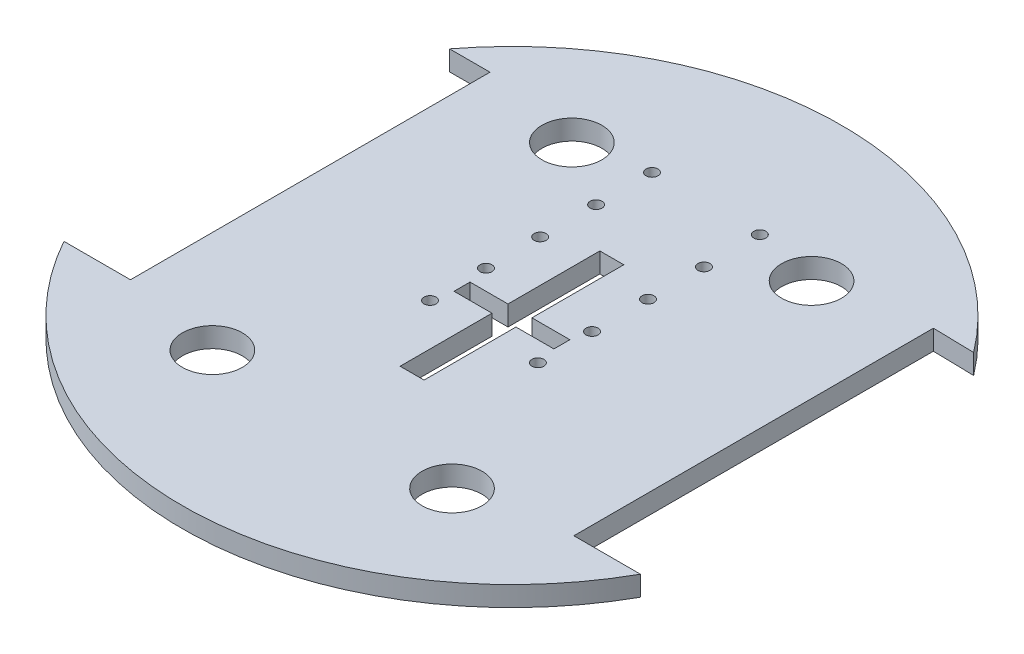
from build123d import *

# Parameters (mm, degrees)
SKETCH1_R           = 82.5
BOSS_EXTRUDE1_DEPTH = 5
CUT_EXTRUDE1_DEPTH  = 117.779707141
SKETCH4_R           = 1.5
CUT_EXTRUDE2_DEPTH  = 110.715541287
SKETCH5_R           = 7.5
CUT_EXTRUDE3_DEPTH  = 110.715541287
SKETCH6_W           = 6
SKETCH6_H           = 50
CUT_EXTRUDE4_DEPTH  = 110.715541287
SKETCH7_W           = 25
SKETCH7_H           = 4
CUT_EXTRUDE5_DEPTH  = 110.715541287


with BuildPart() as part:
    # Sketch1 → Boss-Extrude1 (new body)
    with BuildSketch(Plane(origin=(0, 0, 0), x_dir=(1, 0, 0), z_dir=(0, 1, 0))):
        with Locations(Location((0, 0, 0), (0, 0, 270))):
            Circle(SKETCH1_R)
    extrude(amount=-BOSS_EXTRUDE1_DEPTH)

    # Sketch3 → Cut-Extrude1 (cut, through all)
    with BuildSketch(Plane(origin=(0, -5, 0), x_dir=(-1, 0, 0), z_dir=(0, -1, 0))):
        with BuildLine():
            Line((55.5, 50), (55.5, -40))
            Line((55.5, -40), (72.154348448, -40))
            ThreePointArc((72.154348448, -40), (82.283547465, 5.972253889), (65.622023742, 50))
            Line((65.622023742, 50), (55.5, 50))
        make_face()
        with BuildLine():
            Line((-55.5, 50), (-55.5, -40))
            Line((-55.5, -40), (-72.154348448, -40))
            ThreePointArc((-72.154348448, -40), (-82.293656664, 5.831301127), (-65.792929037, 49.774898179))
            Line((-65.792929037, 49.774898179), (-55.5, 50))
        make_face()
    extrude(amount=-CUT_EXTRUDE1_DEPTH, mode=Mode.SUBTRACT)

    # Sketch4 → Cut-Extrude2 (cut, through all)
    with BuildSketch(Plane(origin=(0, -5, 0), x_dir=(-1, 0, 0), z_dir=(0, -1, 0))):
        with Locations(Location((13.5, -7, 0), (0, 0, 90))):
            Circle(SKETCH4_R)
        with Locations(Location((13.5, 7, 0), (0, 0, 270))):
            Circle(SKETCH4_R)
        with Locations(Location((-13.5, 6.554403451, 0), (0, 0, 90))):
            Circle(SKETCH4_R)
        with Locations(Location((-13.5, -7, 0), (0, 0, 270))):
            Circle(SKETCH4_R)
        with Locations(Location((-13.5, 20.554403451, 0), (0, 0, 90))):
            Circle(SKETCH4_R)
        with Locations(Location((13.5, 20.554403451, 0), (0, 0, 90))):
            Circle(SKETCH4_R)
        with Locations(Location((-13.5, 34.554403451, 0), (0, 0, 90))):
            Circle(SKETCH4_R)
        with Locations(Location((-13.5, 48.554403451, 0), (0, 0, 90))):
            Circle(SKETCH4_R)
        with Locations(Location((13.5, 48.554403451, 0), (0, 0, 90))):
            Circle(SKETCH4_R)
        with Locations(Location((13.5, 34.554403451, 0), (0, 0, 90))):
            Circle(SKETCH4_R)
    extrude(amount=-CUT_EXTRUDE2_DEPTH, mode=Mode.SUBTRACT)

    # Sketch5 → Cut-Extrude3 (cut, through all)
    with BuildSketch(Plane(origin=(0, -5, 0), x_dir=(-1, 0, 0), z_dir=(0, -1, 0))):
        with Locations(Location((30, -45, 0), (0, 0, 90))):
            Circle(SKETCH5_R)
        with Locations(Location((-30, -45, 0), (0, 0, 270))):
            Circle(SKETCH5_R)
        with Locations(Location((30, 45, 0), (0, 0, 270))):
            Circle(SKETCH5_R)
        with Locations(Location((-30, 45, 0), (0, 0, 90))):
            Circle(SKETCH5_R)
    extrude(amount=-CUT_EXTRUDE3_DEPTH, mode=Mode.SUBTRACT)

    # Sketch6 → Cut-Extrude4 (cut, through all)
    with BuildSketch(Plane(origin=(0, -5, 0), x_dir=(-1, 0, 0), z_dir=(0, -1, 0))):
        Rectangle(SKETCH6_W, SKETCH6_H)
    extrude(amount=-CUT_EXTRUDE4_DEPTH, mode=Mode.SUBTRACT)

    # Sketch7 → Cut-Extrude5 (cut, through all)
    with BuildSketch(Plane(origin=(0, -5, 0), x_dir=(-1, 0, 0), z_dir=(0, -1, 0))):
        Rectangle(SKETCH7_W, SKETCH7_H)
    extrude(amount=-CUT_EXTRUDE5_DEPTH, mode=Mode.SUBTRACT)


solid = part.part
